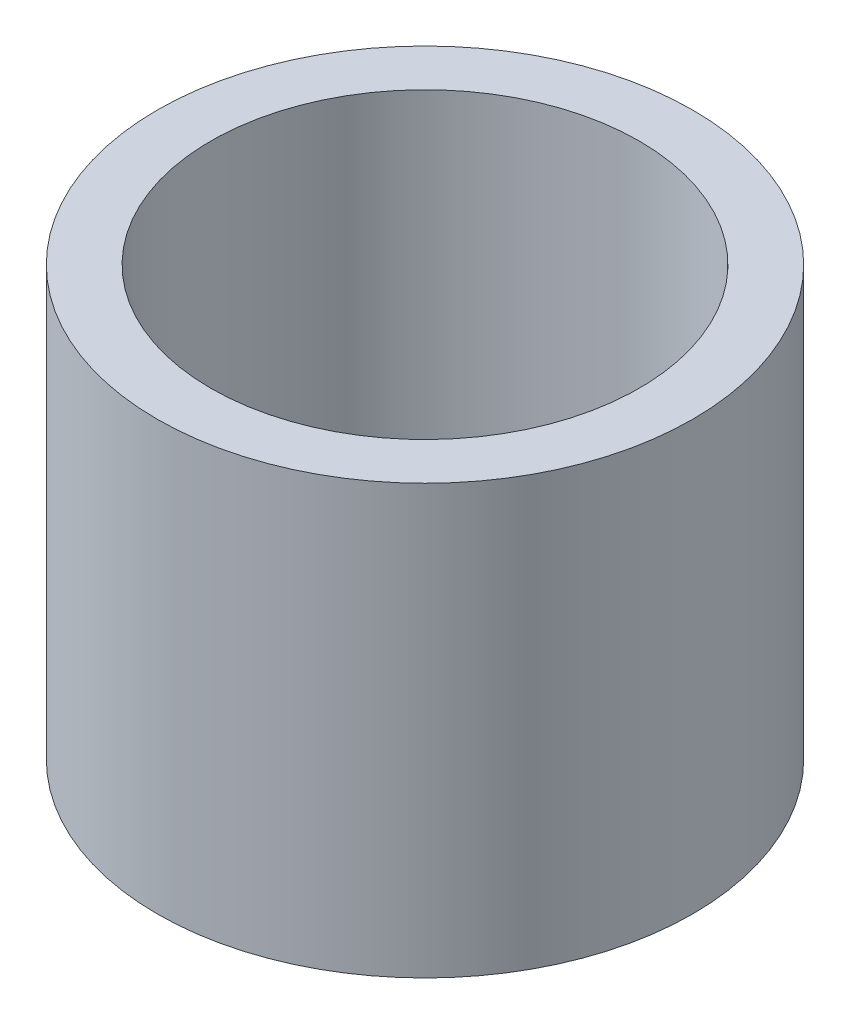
ISO-10303-21;
HEADER;
FILE_DESCRIPTION(('STEP AP214'),'2;1');
FILE_NAME('part.step','',(''),(''),'','','');
FILE_SCHEMA(('AUTOMOTIVE_DESIGN { 1 0 10303 214 1 1 1 1 }'));
ENDSEC;
DATA;
#1=APPLICATION_CONTEXT('core data for automotive mechanical design processes');
#2=APPLICATION_PROTOCOL_DEFINITION('international standard','automotive_design',2000,#1);
#3=PRODUCT_CONTEXT('',#1,'mechanical');
#4=PRODUCT('Part','Part','',(#3));
#5=PRODUCT_RELATED_PRODUCT_CATEGORY('part','',(#4));
#6=PRODUCT_DEFINITION_FORMATION('','',#4);
#7=PRODUCT_DEFINITION_CONTEXT('part definition',#1,'design');
#8=PRODUCT_DEFINITION('design','',#6,#7);
#9=PRODUCT_DEFINITION_SHAPE('','',#8);
#10=(LENGTH_UNIT() NAMED_UNIT(*) SI_UNIT(.MILLI.,.METRE.));
#11=(NAMED_UNIT(*) PLANE_ANGLE_UNIT() SI_UNIT($,.RADIAN.));
#12=(NAMED_UNIT(*) SI_UNIT($,.STERADIAN.) SOLID_ANGLE_UNIT());
#13=UNCERTAINTY_MEASURE_WITH_UNIT(LENGTH_MEASURE(1.E-05),#10,'distance_accuracy_value','');
#14=(GEOMETRIC_REPRESENTATION_CONTEXT(3) GLOBAL_UNCERTAINTY_ASSIGNED_CONTEXT((#13)) GLOBAL_UNIT_ASSIGNED_CONTEXT((#10,
#11,#12)) REPRESENTATION_CONTEXT('',''));
#15=CARTESIAN_POINT('',(0.,0.,0.));
#16=DIRECTION('',(0.,0.,1.));
#17=DIRECTION('',(1.,0.,0.));
#18=AXIS2_PLACEMENT_3D('',#15,#16,#17);
#19=CARTESIAN_POINT('',(0.,-20.,0.));
#20=DIRECTION('',(0.,1.,0.));
#21=DIRECTION('',(0.,0.,1.));
#22=AXIS2_PLACEMENT_3D('',#19,#20,#21);
#23=CYLINDRICAL_SURFACE('',#22,12.5);
#24=CARTESIAN_POINT('',(0.,-20.,0.));
#25=DIRECTION('',(0.,1.,0.));
#26=DIRECTION('',(0.,0.,1.));
#27=AXIS2_PLACEMENT_3D('',#24,#25,#26);
#28=CIRCLE('',#27,12.5);
#29=CARTESIAN_POINT('',(0.,-20.,12.5));
#30=VERTEX_POINT('',#29);
#31=EDGE_CURVE('E10',#30,#30,#28,.T.);
#32=ORIENTED_EDGE('',*,*,#31,.T.);
#33=EDGE_LOOP('',(#32));
#34=FACE_BOUND('',#33,.T.);
#35=CARTESIAN_POINT('',(0.,0.,0.));
#36=DIRECTION('',(0.,1.,0.));
#37=DIRECTION('',(0.,0.,1.));
#38=AXIS2_PLACEMENT_3D('',#35,#36,#37);
#39=CIRCLE('',#38,12.5);
#40=CARTESIAN_POINT('',(0.,0.,12.5));
#41=VERTEX_POINT('',#40);
#42=EDGE_CURVE('E31',#41,#41,#39,.T.);
#43=ORIENTED_EDGE('',*,*,#42,.F.);
#44=EDGE_LOOP('',(#43));
#45=FACE_BOUND('',#44,.T.);
#46=ADVANCED_FACE('F28',(#34,#45),#23,.T.);
#47=CARTESIAN_POINT('',(0.,-20.,0.));
#48=DIRECTION('',(0.,1.,0.));
#49=DIRECTION('',(0.,0.,1.));
#50=AXIS2_PLACEMENT_3D('',#47,#48,#49);
#51=PLANE('',#50);
#52=CARTESIAN_POINT('',(0.,-20.,0.));
#53=DIRECTION('',(0.,1.,0.));
#54=DIRECTION('',(0.,0.,1.));
#55=AXIS2_PLACEMENT_3D('',#52,#53,#54);
#56=CIRCLE('',#55,10.);
#57=CARTESIAN_POINT('',(0.,-20.,10.));
#58=VERTEX_POINT('',#57);
#59=EDGE_CURVE('E38',#58,#58,#56,.T.);
#60=ORIENTED_EDGE('',*,*,#59,.T.);
#61=EDGE_LOOP('',(#60));
#62=FACE_BOUND('',#61,.T.);
#63=ORIENTED_EDGE('',*,*,#31,.F.);
#64=EDGE_LOOP('',(#63));
#65=FACE_BOUND('',#64,.T.);
#66=ADVANCED_FACE('F46',(#62,#65),#51,.F.);
#67=CARTESIAN_POINT('',(0.,0.,0.));
#68=DIRECTION('',(0.,1.,0.));
#69=DIRECTION('',(0.,0.,1.));
#70=AXIS2_PLACEMENT_3D('',#67,#68,#69);
#71=PLANE('',#70);
#72=CARTESIAN_POINT('',(0.,0.,0.));
#73=DIRECTION('',(0.,1.,0.));
#74=DIRECTION('',(0.,0.,1.));
#75=AXIS2_PLACEMENT_3D('',#72,#73,#74);
#76=CIRCLE('',#75,10.);
#77=CARTESIAN_POINT('',(0.,0.,10.));
#78=VERTEX_POINT('',#77);
#79=EDGE_CURVE('E40',#78,#78,#76,.T.);
#80=ORIENTED_EDGE('',*,*,#79,.F.);
#81=EDGE_LOOP('',(#80));
#82=FACE_BOUND('',#81,.T.);
#83=ORIENTED_EDGE('',*,*,#42,.T.);
#84=EDGE_LOOP('',(#83));
#85=FACE_BOUND('',#84,.T.);
#86=ADVANCED_FACE('F52',(#82,#85),#71,.T.);
#87=CARTESIAN_POINT('',(0.,-20.,0.));
#88=DIRECTION('',(0.,1.,0.));
#89=DIRECTION('',(0.,0.,1.));
#90=AXIS2_PLACEMENT_3D('',#87,#88,#89);
#91=CYLINDRICAL_SURFACE('',#90,10.);
#92=ORIENTED_EDGE('',*,*,#59,.F.);
#93=EDGE_LOOP('',(#92));
#94=FACE_BOUND('',#93,.T.);
#95=ORIENTED_EDGE('',*,*,#79,.T.);
#96=EDGE_LOOP('',(#95));
#97=FACE_BOUND('',#96,.T.);
#98=ADVANCED_FACE('F49',(#94,#97),#91,.F.);
#99=CLOSED_SHELL('',(#46,#66,#86,#98));
#100=MANIFOLD_SOLID_BREP('B2',#99);
#101=ADVANCED_BREP_SHAPE_REPRESENTATION('',(#18,#100),#14);
#102=SHAPE_DEFINITION_REPRESENTATION(#9,#101);
ENDSEC;
END-ISO-10303-21;
